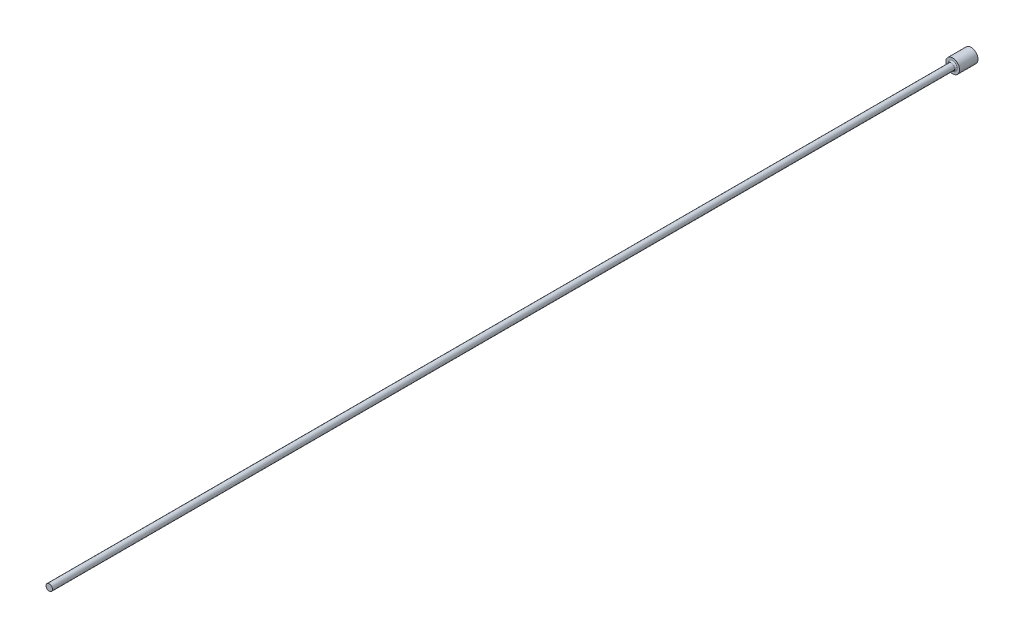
ISO-10303-21;
HEADER;
FILE_DESCRIPTION(('STEP AP214'),'2;1');
FILE_NAME('part.step','',(''),(''),'','','');
FILE_SCHEMA(('AUTOMOTIVE_DESIGN { 1 0 10303 214 1 1 1 1 }'));
ENDSEC;
DATA;
#1=APPLICATION_CONTEXT('core data for automotive mechanical design processes');
#2=APPLICATION_PROTOCOL_DEFINITION('international standard','automotive_design',2000,#1);
#3=PRODUCT_CONTEXT('',#1,'mechanical');
#4=PRODUCT('Part','Part','',(#3));
#5=PRODUCT_RELATED_PRODUCT_CATEGORY('part','',(#4));
#6=PRODUCT_DEFINITION_FORMATION('','',#4);
#7=PRODUCT_DEFINITION_CONTEXT('part definition',#1,'design');
#8=PRODUCT_DEFINITION('design','',#6,#7);
#9=PRODUCT_DEFINITION_SHAPE('','',#8);
#10=(LENGTH_UNIT() NAMED_UNIT(*) SI_UNIT(.MILLI.,.METRE.));
#11=(NAMED_UNIT(*) PLANE_ANGLE_UNIT() SI_UNIT($,.RADIAN.));
#12=(NAMED_UNIT(*) SI_UNIT($,.STERADIAN.) SOLID_ANGLE_UNIT());
#13=UNCERTAINTY_MEASURE_WITH_UNIT(LENGTH_MEASURE(1.E-05),#10,'distance_accuracy_value','');
#14=(GEOMETRIC_REPRESENTATION_CONTEXT(3) GLOBAL_UNCERTAINTY_ASSIGNED_CONTEXT((#13)) GLOBAL_UNIT_ASSIGNED_CONTEXT((#10,
#11,#12)) REPRESENTATION_CONTEXT('',''));
#15=CARTESIAN_POINT('',(0.,0.,0.));
#16=DIRECTION('',(0.,0.,1.));
#17=DIRECTION('',(1.,0.,0.));
#18=AXIS2_PLACEMENT_3D('',#15,#16,#17);
#19=CARTESIAN_POINT('',(1.5,0.,4.));
#20=DIRECTION('',(0.,0.,-1.));
#21=DIRECTION('',(-1.,0.,0.));
#22=AXIS2_PLACEMENT_3D('',#19,#20,#21);
#23=PLANE('',#22);
#24=CARTESIAN_POINT('',(0.,0.,4.));
#25=DIRECTION('',(0.,0.,-1.));
#26=DIRECTION('',(-1.,0.,0.));
#27=AXIS2_PLACEMENT_3D('',#24,#25,#26);
#28=CIRCLE('',#27,1.00000000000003);
#29=CARTESIAN_POINT('',(-1.00000000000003,0.,4.));
#30=VERTEX_POINT('',#29);
#31=EDGE_CURVE('E40',#30,#30,#28,.T.);
#32=ORIENTED_EDGE('',*,*,#31,.T.);
#33=EDGE_LOOP('',(#32));
#34=FACE_BOUND('',#33,.T.);
#35=CARTESIAN_POINT('',(0.,0.,4.));
#36=DIRECTION('',(0.,0.,-1.));
#37=DIRECTION('',(-1.,0.,0.));
#38=AXIS2_PLACEMENT_3D('',#35,#36,#37);
#39=CIRCLE('',#38,1.5);
#40=CARTESIAN_POINT('',(-1.5,0.,4.));
#41=VERTEX_POINT('',#40);
#42=EDGE_CURVE('E44',#41,#41,#39,.T.);
#43=ORIENTED_EDGE('',*,*,#42,.F.);
#44=EDGE_LOOP('',(#43));
#45=FACE_BOUND('',#44,.T.);
#46=ADVANCED_FACE('F33',(#34,#45),#23,.F.);
#47=CARTESIAN_POINT('',(0.,0.,-9.03322817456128));
#48=DIRECTION('',(0.,0.,-1.));
#49=DIRECTION('',(-1.,0.,0.));
#50=AXIS2_PLACEMENT_3D('',#47,#48,#49);
#51=CYLINDRICAL_SURFACE('',#50,1.5);
#52=CARTESIAN_POINT('',(0.,0.,0.));
#53=DIRECTION('',(0.,0.,-1.));
#54=DIRECTION('',(-1.,0.,0.));
#55=AXIS2_PLACEMENT_3D('',#52,#53,#54);
#56=CIRCLE('',#55,1.5);
#57=CARTESIAN_POINT('',(-1.5,0.,0.));
#58=VERTEX_POINT('',#57);
#59=EDGE_CURVE('E48',#58,#58,#56,.T.);
#60=ORIENTED_EDGE('',*,*,#59,.F.);
#61=EDGE_LOOP('',(#60));
#62=FACE_BOUND('',#61,.T.);
#63=ORIENTED_EDGE('',*,*,#42,.T.);
#64=EDGE_LOOP('',(#63));
#65=FACE_BOUND('',#64,.T.);
#66=ADVANCED_FACE('F68',(#62,#65),#51,.T.);
#67=CARTESIAN_POINT('',(0.,0.,0.));
#68=DIRECTION('',(0.,0.,1.));
#69=DIRECTION('',(1.,0.,0.));
#70=AXIS2_PLACEMENT_3D('',#67,#68,#69);
#71=PLANE('',#70);
#72=ORIENTED_EDGE('',*,*,#59,.T.);
#73=EDGE_LOOP('',(#72));
#74=FACE_BOUND('',#73,.T.);
#75=ADVANCED_FACE('F61',(#74),#71,.F.);
#76=CARTESIAN_POINT('',(0.,0.,200.));
#77=DIRECTION('',(0.,0.,-1.));
#78=DIRECTION('',(-1.,0.,0.));
#79=AXIS2_PLACEMENT_3D('',#76,#77,#78);
#80=PLANE('',#79);
#81=CARTESIAN_POINT('',(0.,0.,200.));
#82=DIRECTION('',(0.,0.,-1.));
#83=DIRECTION('',(-1.,0.,0.));
#84=AXIS2_PLACEMENT_3D('',#81,#82,#83);
#85=CIRCLE('',#84,0.700000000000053);
#86=CARTESIAN_POINT('',(-0.700000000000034,0.,200.));
#87=VERTEX_POINT('',#86);
#88=EDGE_CURVE('E53',#87,#87,#85,.T.);
#89=ORIENTED_EDGE('',*,*,#88,.F.);
#90=EDGE_LOOP('',(#89));
#91=FACE_BOUND('',#90,.T.);
#92=ADVANCED_FACE('F59',(#91),#80,.F.);
#93=CARTESIAN_POINT('',(0.,0.,-9.03322817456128));
#94=DIRECTION('',(0.,0.,-1.));
#95=DIRECTION('',(-1.,0.,0.));
#96=AXIS2_PLACEMENT_3D('',#93,#94,#95);
#97=CYLINDRICAL_SURFACE('',#96,0.700000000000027);
#98=CARTESIAN_POINT('',(0.,0.,4.3));
#99=DIRECTION('',(0.,0.,-1.));
#100=DIRECTION('',(-1.,0.,0.));
#101=AXIS2_PLACEMENT_3D('',#98,#99,#100);
#102=CIRCLE('',#101,0.700000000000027);
#103=CARTESIAN_POINT('',(-0.700000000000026,0.,4.3));
#104=VERTEX_POINT('',#103);
#105=EDGE_CURVE('E10',#104,#104,#102,.F.);
#106=ORIENTED_EDGE('',*,*,#105,.T.);
#107=EDGE_LOOP('',(#106));
#108=FACE_BOUND('',#107,.T.);
#109=ORIENTED_EDGE('',*,*,#88,.T.);
#110=EDGE_LOOP('',(#109));
#111=FACE_BOUND('',#110,.T.);
#112=ADVANCED_FACE('F57',(#108,#111),#97,.T.);
#113=CARTESIAN_POINT('',(0.,0.,4.3));
#114=DIRECTION('',(0.,0.,-1.));
#115=DIRECTION('',(-1.,0.,0.));
#116=AXIS2_PLACEMENT_3D('',#113,#114,#115);
#117=TOROIDAL_SURFACE('',#116,1.00000000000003,0.3);
#118=ORIENTED_EDGE('',*,*,#105,.F.);
#119=EDGE_LOOP('',(#118));
#120=FACE_BOUND('',#119,.T.);
#121=ORIENTED_EDGE('',*,*,#31,.F.);
#122=EDGE_LOOP('',(#121));
#123=FACE_BOUND('',#122,.T.);
#124=ADVANCED_FACE('F35',(#120,#123),#117,.F.);
#125=CLOSED_SHELL('',(#46,#66,#75,#92,#112,#124));
#126=MANIFOLD_SOLID_BREP('B2',#125);
#127=ADVANCED_BREP_SHAPE_REPRESENTATION('',(#18,#126),#14);
#128=SHAPE_DEFINITION_REPRESENTATION(#9,#127);
ENDSEC;
END-ISO-10303-21;
